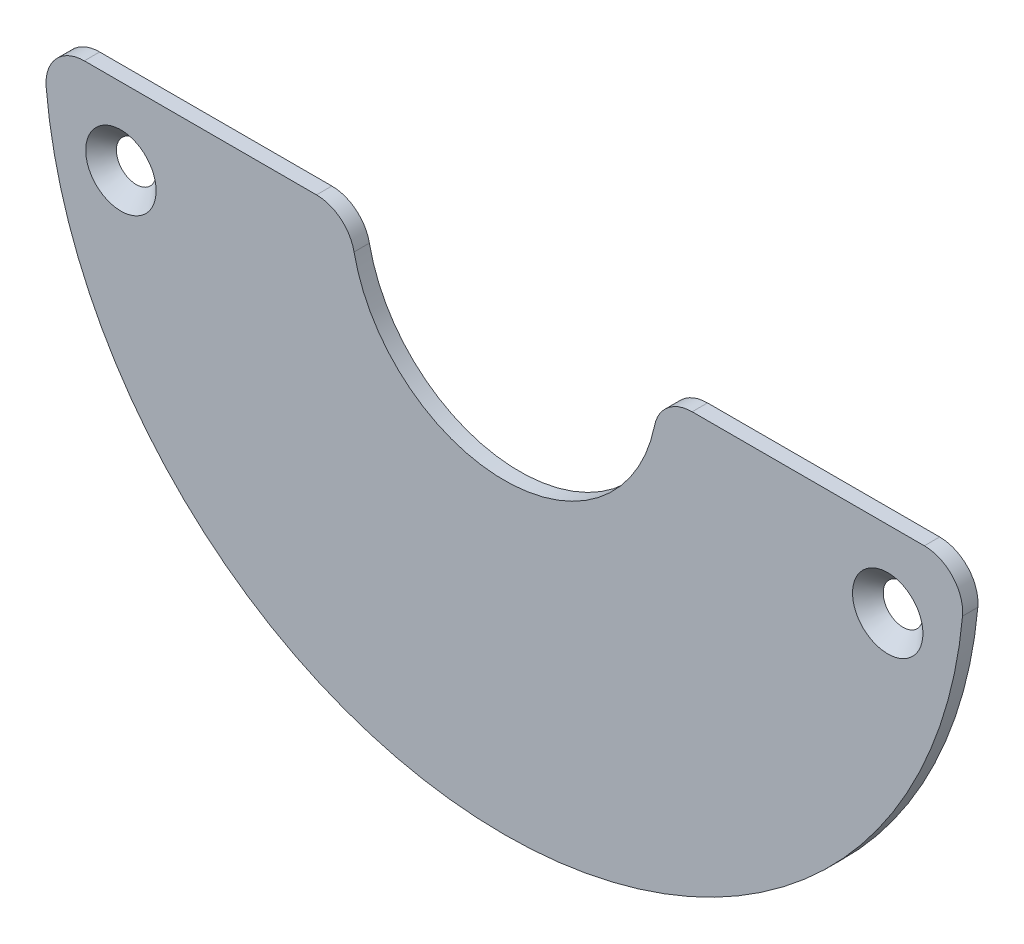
from build123d import *

# Parameters (mm, degrees)
AUFSATZ_LINEAR_AUSTRAGEN1_DEPTH             = 2
FORMSENKUNG_F_R_M4_SENKSCHRAUBE_MIT_2_COUNT = 2
FORMSENKUNG_F_R_M4_SENKSCHRAUBE_MIT_2_PITCH = 100


with BuildPart() as part:
    # Skizze1 → Aufsatz-Linear austragen1 (new body)
    with BuildSketch(Plane.XY):
        with BuildLine():
            Line((-54.772255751, 0), (-24.494897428, 0))
            ThreePointArc((-24.494897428, 0), (-21.332619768, -1.127016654), (-19.595917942, -4))
            ThreePointArc((-19.595917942, -4), (0, -20), (19.595917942, -4))
            ThreePointArc((19.595917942, -4), (21.332619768, -1.127016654), (24.494897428, 0))
            Line((24.494897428, 0), (54.772255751, 0))
            ThreePointArc((54.772255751, 0), (58.46500048, -1.629000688), (59.751551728, -5.454545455))
            ThreePointArc((59.751551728, -5.454545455), (0, -60), (-59.751551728, -5.454545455))
            ThreePointArc((-59.751551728, -5.454545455), (-58.46500048, -1.629000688), (-54.772255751, 0))
        make_face()
    extrude(amount=AUFSATZ_LINEAR_AUSTRAGEN1_DEPTH)

    # Skizze2 → Formsenkung f_r M4 Senkschraube mit Inne (revolve, cut)
    with BuildSketch(Plane(origin=(-50, -10, 2), x_dir=(0, -1, 0), z_dir=(1, 0, 0))):
        Polygon((0, 0), (0, 2), (2.25, 2), (2.25, 2.34), (4.59, 0), align=None)
    formsenkung_f_r_m4_senkschraube_mit_inne = revolve(axis=Axis((-50, -10, 8.35), (0, 0, -1)), mode=Mode.SUBTRACT)

    # Formsenkung f_r M4 Senkschraube mit  2: Formsenkung f_r M4 Senkschraube mit Inne ×2
    with Locations(*[(i * FORMSENKUNG_F_R_M4_SENKSCHRAUBE_MIT_2_PITCH, 0, 0) for i in range(1, FORMSENKUNG_F_R_M4_SENKSCHRAUBE_MIT_2_COUNT)]):
        add(formsenkung_f_r_m4_senkschraube_mit_inne, mode=Mode.SUBTRACT)


solid = part.part
